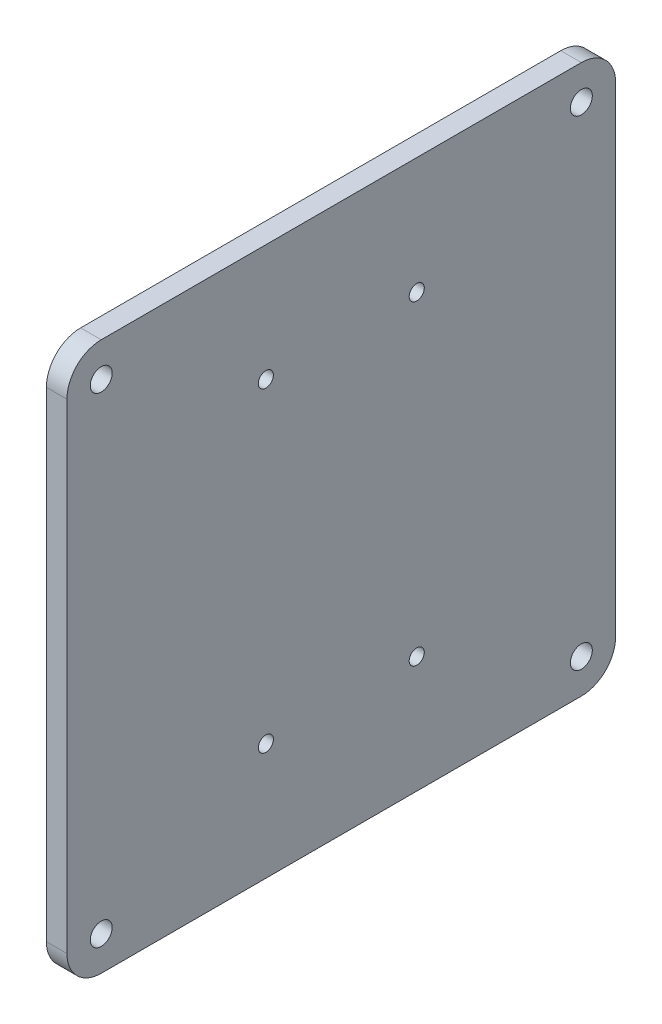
ISO-10303-21;
HEADER;
FILE_DESCRIPTION(('STEP AP214'),'2;1');
FILE_NAME('part.step','',(''),(''),'','','');
FILE_SCHEMA(('AUTOMOTIVE_DESIGN { 1 0 10303 214 1 1 1 1 }'));
ENDSEC;
DATA;
#1=APPLICATION_CONTEXT('core data for automotive mechanical design processes');
#2=APPLICATION_PROTOCOL_DEFINITION('international standard','automotive_design',2000,#1);
#3=PRODUCT_CONTEXT('',#1,'mechanical');
#4=PRODUCT('Part','Part','',(#3));
#5=PRODUCT_RELATED_PRODUCT_CATEGORY('part','',(#4));
#6=PRODUCT_DEFINITION_FORMATION('','',#4);
#7=PRODUCT_DEFINITION_CONTEXT('part definition',#1,'design');
#8=PRODUCT_DEFINITION('design','',#6,#7);
#9=PRODUCT_DEFINITION_SHAPE('','',#8);
#10=(LENGTH_UNIT() NAMED_UNIT(*) SI_UNIT(.MILLI.,.METRE.));
#11=(NAMED_UNIT(*) PLANE_ANGLE_UNIT() SI_UNIT($,.RADIAN.));
#12=(NAMED_UNIT(*) SI_UNIT($,.STERADIAN.) SOLID_ANGLE_UNIT());
#13=UNCERTAINTY_MEASURE_WITH_UNIT(LENGTH_MEASURE(1.E-05),#10,'distance_accuracy_value','');
#14=(GEOMETRIC_REPRESENTATION_CONTEXT(3) GLOBAL_UNCERTAINTY_ASSIGNED_CONTEXT((#13)) GLOBAL_UNIT_ASSIGNED_CONTEXT((#10,
#11,#12)) REPRESENTATION_CONTEXT('',''));
#15=CARTESIAN_POINT('',(0.,0.,0.));
#16=DIRECTION('',(0.,0.,1.));
#17=DIRECTION('',(1.,0.,0.));
#18=AXIS2_PLACEMENT_3D('',#15,#16,#17);
#19=CARTESIAN_POINT('',(3.,-35.,35.));
#20=DIRECTION('',(-1.,0.,0.));
#21=DIRECTION('',(0.,0.,1.));
#22=AXIS2_PLACEMENT_3D('',#19,#20,#21);
#23=PLANE('',#22);
#24=CARTESIAN_POINT('',(3.,-23.,11.));
#25=DIRECTION('',(1.,0.,0.));
#26=DIRECTION('',(0.,0.,1.));
#27=AXIS2_PLACEMENT_3D('',#24,#25,#26);
#28=CIRCLE('',#27,1.1);
#29=CARTESIAN_POINT('',(3.,-23.,12.1));
#30=VERTEX_POINT('',#29);
#31=EDGE_CURVE('E212',#30,#30,#28,.T.);
#32=ORIENTED_EDGE('',*,*,#31,.F.);
#33=EDGE_LOOP('',(#32));
#34=FACE_BOUND('',#33,.T.);
#35=CARTESIAN_POINT('',(3.,-35.,-35.));
#36=DIRECTION('',(1.,0.,0.));
#37=DIRECTION('',(0.,0.,-1.));
#38=AXIS2_PLACEMENT_3D('',#35,#36,#37);
#39=CIRCLE('',#38,1.6);
#40=CARTESIAN_POINT('',(3.,-35.,-36.6));
#41=VERTEX_POINT('',#40);
#42=EDGE_CURVE('E200',#41,#41,#39,.T.);
#43=ORIENTED_EDGE('',*,*,#42,.F.);
#44=EDGE_LOOP('',(#43));
#45=FACE_BOUND('',#44,.T.);
#46=CARTESIAN_POINT('',(3.,35.,-35.));
#47=DIRECTION('',(1.,0.,0.));
#48=DIRECTION('',(0.,0.,1.));
#49=AXIS2_PLACEMENT_3D('',#46,#47,#48);
#50=CIRCLE('',#49,1.6);
#51=CARTESIAN_POINT('',(3.,35.,-33.4));
#52=VERTEX_POINT('',#51);
#53=EDGE_CURVE('E188',#52,#52,#50,.T.);
#54=ORIENTED_EDGE('',*,*,#53,.F.);
#55=EDGE_LOOP('',(#54));
#56=FACE_BOUND('',#55,.T.);
#57=CARTESIAN_POINT('',(3.,35.,35.));
#58=DIRECTION('',(1.,0.,0.));
#59=DIRECTION('',(0.,0.,-1.));
#60=AXIS2_PLACEMENT_3D('',#57,#58,#59);
#61=CIRCLE('',#60,1.6);
#62=CARTESIAN_POINT('',(3.,35.,33.4));
#63=VERTEX_POINT('',#62);
#64=EDGE_CURVE('E134',#63,#63,#61,.T.);
#65=ORIENTED_EDGE('',*,*,#64,.F.);
#66=EDGE_LOOP('',(#65));
#67=FACE_BOUND('',#66,.T.);
#68=CARTESIAN_POINT('',(3.,-35.,35.));
#69=DIRECTION('',(1.,0.,0.));
#70=DIRECTION('',(0.,0.,1.));
#71=AXIS2_PLACEMENT_3D('',#68,#69,#70);
#72=CIRCLE('',#71,5.);
#73=CARTESIAN_POINT('',(3.,-35.,40.));
#74=VERTEX_POINT('',#73);
#75=CARTESIAN_POINT('',(3.,-40.,35.));
#76=VERTEX_POINT('',#75);
#77=EDGE_CURVE('E145',#74,#76,#72,.T.);
#78=ORIENTED_EDGE('',*,*,#77,.T.);
#79=DIRECTION('',(0.,0.,-1.));
#80=VECTOR('',#79,1.);
#81=CARTESIAN_POINT('',(3.,-40.,-35.));
#82=LINE('',#81,#80);
#83=CARTESIAN_POINT('',(3.,-40.,-35.));
#84=VERTEX_POINT('',#83);
#85=EDGE_CURVE('E93',#76,#84,#82,.T.);
#86=ORIENTED_EDGE('',*,*,#85,.T.);
#87=CARTESIAN_POINT('',(3.,-35.,-35.));
#88=DIRECTION('',(1.,0.,0.));
#89=DIRECTION('',(0.,0.,1.));
#90=AXIS2_PLACEMENT_3D('',#87,#88,#89);
#91=CIRCLE('',#90,5.);
#92=CARTESIAN_POINT('',(3.,-35.,-40.));
#93=VERTEX_POINT('',#92);
#94=EDGE_CURVE('E160',#84,#93,#91,.T.);
#95=ORIENTED_EDGE('',*,*,#94,.T.);
#96=DIRECTION('',(0.,1.,0.));
#97=VECTOR('',#96,1.);
#98=CARTESIAN_POINT('',(3.,35.,-40.));
#99=LINE('',#98,#97);
#100=CARTESIAN_POINT('',(3.,35.,-40.));
#101=VERTEX_POINT('',#100);
#102=EDGE_CURVE('E173',#93,#101,#99,.T.);
#103=ORIENTED_EDGE('',*,*,#102,.T.);
#104=CARTESIAN_POINT('',(3.,35.,-35.));
#105=DIRECTION('',(1.,0.,0.));
#106=DIRECTION('',(0.,0.,1.));
#107=AXIS2_PLACEMENT_3D('',#104,#105,#106);
#108=CIRCLE('',#107,5.);
#109=CARTESIAN_POINT('',(3.,40.,-35.));
#110=VERTEX_POINT('',#109);
#111=EDGE_CURVE('E112',#101,#110,#108,.T.);
#112=ORIENTED_EDGE('',*,*,#111,.T.);
#113=DIRECTION('',(0.,0.,1.));
#114=VECTOR('',#113,1.);
#115=CARTESIAN_POINT('',(3.,40.,-35.));
#116=LINE('',#115,#114);
#117=CARTESIAN_POINT('',(3.,40.,35.));
#118=VERTEX_POINT('',#117);
#119=EDGE_CURVE('E106',#110,#118,#116,.T.);
#120=ORIENTED_EDGE('',*,*,#119,.T.);
#121=CARTESIAN_POINT('',(3.,35.,35.));
#122=DIRECTION('',(1.,0.,0.));
#123=DIRECTION('',(0.,0.,-1.));
#124=AXIS2_PLACEMENT_3D('',#121,#122,#123);
#125=CIRCLE('',#124,5.);
#126=CARTESIAN_POINT('',(3.,35.,40.));
#127=VERTEX_POINT('',#126);
#128=EDGE_CURVE('E110',#118,#127,#125,.T.);
#129=ORIENTED_EDGE('',*,*,#128,.T.);
#130=DIRECTION('',(0.,-1.,0.));
#131=VECTOR('',#130,1.);
#132=CARTESIAN_POINT('',(3.,35.,40.));
#133=LINE('',#132,#131);
#134=EDGE_CURVE('E50',#127,#74,#133,.T.);
#135=ORIENTED_EDGE('',*,*,#134,.T.);
#136=EDGE_LOOP('',(#78,#86,#95,#103,#112,#120,#129,#135));
#137=FACE_BOUND('',#136,.T.);
#138=CARTESIAN_POINT('',(3.,23.,11.));
#139=DIRECTION('',(1.,0.,0.));
#140=DIRECTION('',(0.,0.,-1.));
#141=AXIS2_PLACEMENT_3D('',#138,#139,#140);
#142=CIRCLE('',#141,1.1);
#143=CARTESIAN_POINT('',(3.,23.,9.9));
#144=VERTEX_POINT('',#143);
#145=EDGE_CURVE('E182',#144,#144,#142,.T.);
#146=ORIENTED_EDGE('',*,*,#145,.F.);
#147=EDGE_LOOP('',(#146));
#148=FACE_BOUND('',#147,.T.);
#149=CARTESIAN_POINT('',(3.,23.,-11.));
#150=DIRECTION('',(1.,0.,0.));
#151=DIRECTION('',(0.,0.,1.));
#152=AXIS2_PLACEMENT_3D('',#149,#150,#151);
#153=CIRCLE('',#152,1.1);
#154=CARTESIAN_POINT('',(3.,23.,-9.9));
#155=VERTEX_POINT('',#154);
#156=EDGE_CURVE('E194',#155,#155,#153,.T.);
#157=ORIENTED_EDGE('',*,*,#156,.F.);
#158=EDGE_LOOP('',(#157));
#159=FACE_BOUND('',#158,.T.);
#160=CARTESIAN_POINT('',(3.,-23.,-11.));
#161=DIRECTION('',(1.,0.,0.));
#162=DIRECTION('',(0.,0.,-1.));
#163=AXIS2_PLACEMENT_3D('',#160,#161,#162);
#164=CIRCLE('',#163,1.1);
#165=CARTESIAN_POINT('',(3.,-23.,-12.1));
#166=VERTEX_POINT('',#165);
#167=EDGE_CURVE('E206',#166,#166,#164,.T.);
#168=ORIENTED_EDGE('',*,*,#167,.F.);
#169=EDGE_LOOP('',(#168));
#170=FACE_BOUND('',#169,.T.);
#171=CARTESIAN_POINT('',(3.,-35.,35.));
#172=DIRECTION('',(1.,0.,0.));
#173=DIRECTION('',(0.,0.,1.));
#174=AXIS2_PLACEMENT_3D('',#171,#172,#173);
#175=CIRCLE('',#174,1.6);
#176=CARTESIAN_POINT('',(3.,-35.,36.6));
#177=VERTEX_POINT('',#176);
#178=EDGE_CURVE('E218',#177,#177,#175,.T.);
#179=ORIENTED_EDGE('',*,*,#178,.F.);
#180=EDGE_LOOP('',(#179));
#181=FACE_BOUND('',#180,.T.);
#182=ADVANCED_FACE('F33',(#34,#45,#56,#67,#137,#148,#159,#170,#181),#23,.F.);
#183=CARTESIAN_POINT('',(0.,-35.,35.));
#184=DIRECTION('',(-1.,0.,0.));
#185=DIRECTION('',(0.,0.,1.));
#186=AXIS2_PLACEMENT_3D('',#183,#184,#185);
#187=PLANE('',#186);
#188=CARTESIAN_POINT('',(0.,-23.,11.));
#189=DIRECTION('',(1.,0.,0.));
#190=DIRECTION('',(0.,0.,1.));
#191=AXIS2_PLACEMENT_3D('',#188,#189,#190);
#192=CIRCLE('',#191,1.1);
#193=CARTESIAN_POINT('',(0.,-23.,12.1));
#194=VERTEX_POINT('',#193);
#195=EDGE_CURVE('E215',#194,#194,#192,.T.);
#196=ORIENTED_EDGE('',*,*,#195,.T.);
#197=EDGE_LOOP('',(#196));
#198=FACE_BOUND('',#197,.T.);
#199=CARTESIAN_POINT('',(0.,-35.,-35.));
#200=DIRECTION('',(1.,0.,0.));
#201=DIRECTION('',(0.,0.,-1.));
#202=AXIS2_PLACEMENT_3D('',#199,#200,#201);
#203=CIRCLE('',#202,1.6);
#204=CARTESIAN_POINT('',(0.,-35.,-36.6));
#205=VERTEX_POINT('',#204);
#206=EDGE_CURVE('E203',#205,#205,#203,.T.);
#207=ORIENTED_EDGE('',*,*,#206,.T.);
#208=EDGE_LOOP('',(#207));
#209=FACE_BOUND('',#208,.T.);
#210=CARTESIAN_POINT('',(0.,35.,-35.));
#211=DIRECTION('',(1.,0.,0.));
#212=DIRECTION('',(0.,0.,1.));
#213=AXIS2_PLACEMENT_3D('',#210,#211,#212);
#214=CIRCLE('',#213,1.6);
#215=CARTESIAN_POINT('',(0.,35.,-33.4));
#216=VERTEX_POINT('',#215);
#217=EDGE_CURVE('E191',#216,#216,#214,.T.);
#218=ORIENTED_EDGE('',*,*,#217,.T.);
#219=EDGE_LOOP('',(#218));
#220=FACE_BOUND('',#219,.T.);
#221=CARTESIAN_POINT('',(0.,35.,35.));
#222=DIRECTION('',(1.,0.,0.));
#223=DIRECTION('',(0.,0.,-1.));
#224=AXIS2_PLACEMENT_3D('',#221,#222,#223);
#225=CIRCLE('',#224,1.6);
#226=CARTESIAN_POINT('',(0.,35.,33.4));
#227=VERTEX_POINT('',#226);
#228=EDGE_CURVE('E179',#227,#227,#225,.T.);
#229=ORIENTED_EDGE('',*,*,#228,.T.);
#230=EDGE_LOOP('',(#229));
#231=FACE_BOUND('',#230,.T.);
#232=CARTESIAN_POINT('',(0.,-35.,35.));
#233=DIRECTION('',(1.,0.,0.));
#234=DIRECTION('',(0.,0.,1.));
#235=AXIS2_PLACEMENT_3D('',#232,#233,#234);
#236=CIRCLE('',#235,5.);
#237=CARTESIAN_POINT('',(0.,-35.,40.));
#238=VERTEX_POINT('',#237);
#239=CARTESIAN_POINT('',(0.,-40.,35.));
#240=VERTEX_POINT('',#239);
#241=EDGE_CURVE('E130',#238,#240,#236,.T.);
#242=ORIENTED_EDGE('',*,*,#241,.F.);
#243=DIRECTION('',(0.,-1.,0.));
#244=VECTOR('',#243,1.);
#245=CARTESIAN_POINT('',(0.,35.,40.));
#246=LINE('',#245,#244);
#247=CARTESIAN_POINT('',(0.,35.,40.));
#248=VERTEX_POINT('',#247);
#249=EDGE_CURVE('E85',#248,#238,#246,.T.);
#250=ORIENTED_EDGE('',*,*,#249,.F.);
#251=CARTESIAN_POINT('',(0.,35.,35.));
#252=DIRECTION('',(1.,0.,0.));
#253=DIRECTION('',(0.,0.,-1.));
#254=AXIS2_PLACEMENT_3D('',#251,#252,#253);
#255=CIRCLE('',#254,5.);
#256=CARTESIAN_POINT('',(0.,40.,35.));
#257=VERTEX_POINT('',#256);
#258=EDGE_CURVE('E79',#257,#248,#255,.T.);
#259=ORIENTED_EDGE('',*,*,#258,.F.);
#260=DIRECTION('',(0.,0.,1.));
#261=VECTOR('',#260,1.);
#262=CARTESIAN_POINT('',(0.,40.,-35.));
#263=LINE('',#262,#261);
#264=CARTESIAN_POINT('',(0.,40.,-35.));
#265=VERTEX_POINT('',#264);
#266=EDGE_CURVE('E120',#265,#257,#263,.T.);
#267=ORIENTED_EDGE('',*,*,#266,.F.);
#268=CARTESIAN_POINT('',(0.,35.,-35.));
#269=DIRECTION('',(1.,0.,0.));
#270=DIRECTION('',(0.,0.,1.));
#271=AXIS2_PLACEMENT_3D('',#268,#269,#270);
#272=CIRCLE('',#271,5.);
#273=CARTESIAN_POINT('',(0.,35.,-40.));
#274=VERTEX_POINT('',#273);
#275=EDGE_CURVE('E140',#274,#265,#272,.T.);
#276=ORIENTED_EDGE('',*,*,#275,.F.);
#277=DIRECTION('',(0.,1.,0.));
#278=VECTOR('',#277,1.);
#279=CARTESIAN_POINT('',(0.,35.,-40.));
#280=LINE('',#279,#278);
#281=CARTESIAN_POINT('',(0.,-35.,-40.));
#282=VERTEX_POINT('',#281);
#283=EDGE_CURVE('E138',#282,#274,#280,.T.);
#284=ORIENTED_EDGE('',*,*,#283,.F.);
#285=CARTESIAN_POINT('',(0.,-35.,-35.));
#286=DIRECTION('',(1.,0.,0.));
#287=DIRECTION('',(0.,0.,1.));
#288=AXIS2_PLACEMENT_3D('',#285,#286,#287);
#289=CIRCLE('',#288,5.);
#290=CARTESIAN_POINT('',(0.,-40.,-35.));
#291=VERTEX_POINT('',#290);
#292=EDGE_CURVE('E136',#291,#282,#289,.T.);
#293=ORIENTED_EDGE('',*,*,#292,.F.);
#294=DIRECTION('',(0.,0.,-1.));
#295=VECTOR('',#294,1.);
#296=CARTESIAN_POINT('',(0.,-40.,-35.));
#297=LINE('',#296,#295);
#298=EDGE_CURVE('E133',#240,#291,#297,.T.);
#299=ORIENTED_EDGE('',*,*,#298,.F.);
#300=EDGE_LOOP('',(#242,#250,#259,#267,#276,#284,#293,#299));
#301=FACE_BOUND('',#300,.T.);
#302=CARTESIAN_POINT('',(0.,23.,11.));
#303=DIRECTION('',(1.,0.,0.));
#304=DIRECTION('',(0.,0.,-1.));
#305=AXIS2_PLACEMENT_3D('',#302,#303,#304);
#306=CIRCLE('',#305,1.1);
#307=CARTESIAN_POINT('',(0.,23.,9.9));
#308=VERTEX_POINT('',#307);
#309=EDGE_CURVE('E185',#308,#308,#306,.T.);
#310=ORIENTED_EDGE('',*,*,#309,.T.);
#311=EDGE_LOOP('',(#310));
#312=FACE_BOUND('',#311,.T.);
#313=CARTESIAN_POINT('',(0.,23.,-11.));
#314=DIRECTION('',(1.,0.,0.));
#315=DIRECTION('',(0.,0.,1.));
#316=AXIS2_PLACEMENT_3D('',#313,#314,#315);
#317=CIRCLE('',#316,1.1);
#318=CARTESIAN_POINT('',(0.,23.,-9.9));
#319=VERTEX_POINT('',#318);
#320=EDGE_CURVE('E197',#319,#319,#317,.T.);
#321=ORIENTED_EDGE('',*,*,#320,.T.);
#322=EDGE_LOOP('',(#321));
#323=FACE_BOUND('',#322,.T.);
#324=CARTESIAN_POINT('',(0.,-23.,-11.));
#325=DIRECTION('',(1.,0.,0.));
#326=DIRECTION('',(0.,0.,-1.));
#327=AXIS2_PLACEMENT_3D('',#324,#325,#326);
#328=CIRCLE('',#327,1.1);
#329=CARTESIAN_POINT('',(0.,-23.,-12.1));
#330=VERTEX_POINT('',#329);
#331=EDGE_CURVE('E209',#330,#330,#328,.T.);
#332=ORIENTED_EDGE('',*,*,#331,.T.);
#333=EDGE_LOOP('',(#332));
#334=FACE_BOUND('',#333,.T.);
#335=CARTESIAN_POINT('',(0.,-35.,35.));
#336=DIRECTION('',(1.,0.,0.));
#337=DIRECTION('',(0.,0.,1.));
#338=AXIS2_PLACEMENT_3D('',#335,#336,#337);
#339=CIRCLE('',#338,1.6);
#340=CARTESIAN_POINT('',(0.,-35.,36.6));
#341=VERTEX_POINT('',#340);
#342=EDGE_CURVE('E221',#341,#341,#339,.T.);
#343=ORIENTED_EDGE('',*,*,#342,.T.);
#344=EDGE_LOOP('',(#343));
#345=FACE_BOUND('',#344,.T.);
#346=ADVANCED_FACE('F164',(#198,#209,#220,#231,#301,#312,#323,#334,#345),#187,.T.);
#347=CARTESIAN_POINT('',(3.,-35.,35.));
#348=DIRECTION('',(-1.,0.,0.));
#349=DIRECTION('',(0.,0.,1.));
#350=AXIS2_PLACEMENT_3D('',#347,#348,#349);
#351=CYLINDRICAL_SURFACE('',#350,5.);
#352=ORIENTED_EDGE('',*,*,#241,.T.);
#353=DIRECTION('',(-1.,0.,0.));
#354=VECTOR('',#353,1.);
#355=CARTESIAN_POINT('',(3.,-40.,35.));
#356=LINE('',#355,#354);
#357=EDGE_CURVE('E11',#76,#240,#356,.T.);
#358=ORIENTED_EDGE('',*,*,#357,.F.);
#359=ORIENTED_EDGE('',*,*,#77,.F.);
#360=DIRECTION('',(-1.,0.,0.));
#361=VECTOR('',#360,1.);
#362=CARTESIAN_POINT('',(3.,-35.,40.));
#363=LINE('',#362,#361);
#364=EDGE_CURVE('E126',#74,#238,#363,.T.);
#365=ORIENTED_EDGE('',*,*,#364,.T.);
#366=EDGE_LOOP('',(#352,#358,#359,#365));
#367=FACE_BOUND('',#366,.T.);
#368=ADVANCED_FACE('F35',(#367),#351,.T.);
#369=CARTESIAN_POINT('',(3.,-40.,-35.));
#370=DIRECTION('',(0.,1.,0.));
#371=DIRECTION('',(0.,0.,1.));
#372=AXIS2_PLACEMENT_3D('',#369,#370,#371);
#373=PLANE('',#372);
#374=ORIENTED_EDGE('',*,*,#298,.T.);
#375=DIRECTION('',(-1.,0.,0.));
#376=VECTOR('',#375,1.);
#377=CARTESIAN_POINT('',(3.,-40.,-35.));
#378=LINE('',#377,#376);
#379=EDGE_CURVE('E42',#84,#291,#378,.T.);
#380=ORIENTED_EDGE('',*,*,#379,.F.);
#381=ORIENTED_EDGE('',*,*,#85,.F.);
#382=ORIENTED_EDGE('',*,*,#357,.T.);
#383=EDGE_LOOP('',(#374,#380,#381,#382));
#384=FACE_BOUND('',#383,.T.);
#385=ADVANCED_FACE('F256',(#384),#373,.F.);
#386=CARTESIAN_POINT('',(3.,-35.,-35.));
#387=DIRECTION('',(-1.,0.,0.));
#388=DIRECTION('',(0.,0.,1.));
#389=AXIS2_PLACEMENT_3D('',#386,#387,#388);
#390=CYLINDRICAL_SURFACE('',#389,5.);
#391=ORIENTED_EDGE('',*,*,#292,.T.);
#392=DIRECTION('',(-1.,0.,0.));
#393=VECTOR('',#392,1.);
#394=CARTESIAN_POINT('',(3.,-35.,-40.));
#395=LINE('',#394,#393);
#396=EDGE_CURVE('E152',#93,#282,#395,.T.);
#397=ORIENTED_EDGE('',*,*,#396,.F.);
#398=ORIENTED_EDGE('',*,*,#94,.F.);
#399=ORIENTED_EDGE('',*,*,#379,.T.);
#400=EDGE_LOOP('',(#391,#397,#398,#399));
#401=FACE_BOUND('',#400,.T.);
#402=ADVANCED_FACE('F158',(#401),#390,.T.);
#403=CARTESIAN_POINT('',(3.,35.,-40.));
#404=DIRECTION('',(0.,0.,1.));
#405=DIRECTION('',(0.,-1.,0.));
#406=AXIS2_PLACEMENT_3D('',#403,#404,#405);
#407=PLANE('',#406);
#408=ORIENTED_EDGE('',*,*,#283,.T.);
#409=DIRECTION('',(-1.,0.,0.));
#410=VECTOR('',#409,1.);
#411=CARTESIAN_POINT('',(3.,35.,-40.));
#412=LINE('',#411,#410);
#413=EDGE_CURVE('E149',#101,#274,#412,.T.);
#414=ORIENTED_EDGE('',*,*,#413,.F.);
#415=ORIENTED_EDGE('',*,*,#102,.F.);
#416=ORIENTED_EDGE('',*,*,#396,.T.);
#417=EDGE_LOOP('',(#408,#414,#415,#416));
#418=FACE_BOUND('',#417,.T.);
#419=ADVANCED_FACE('F169',(#418),#407,.F.);
#420=CARTESIAN_POINT('',(3.,35.,-35.));
#421=DIRECTION('',(-1.,0.,0.));
#422=DIRECTION('',(0.,0.,1.));
#423=AXIS2_PLACEMENT_3D('',#420,#421,#422);
#424=CYLINDRICAL_SURFACE('',#423,5.);
#425=ORIENTED_EDGE('',*,*,#275,.T.);
#426=DIRECTION('',(-1.,0.,0.));
#427=VECTOR('',#426,1.);
#428=CARTESIAN_POINT('',(3.,40.,-35.));
#429=LINE('',#428,#427);
#430=EDGE_CURVE('E121',#110,#265,#429,.T.);
#431=ORIENTED_EDGE('',*,*,#430,.F.);
#432=ORIENTED_EDGE('',*,*,#111,.F.);
#433=ORIENTED_EDGE('',*,*,#413,.T.);
#434=EDGE_LOOP('',(#425,#431,#432,#433));
#435=FACE_BOUND('',#434,.T.);
#436=ADVANCED_FACE('F172',(#435),#424,.T.);
#437=CARTESIAN_POINT('',(3.,40.,-35.));
#438=DIRECTION('',(0.,-1.,0.));
#439=DIRECTION('',(0.,0.,-1.));
#440=AXIS2_PLACEMENT_3D('',#437,#438,#439);
#441=PLANE('',#440);
#442=ORIENTED_EDGE('',*,*,#266,.T.);
#443=DIRECTION('',(-1.,0.,0.));
#444=VECTOR('',#443,1.);
#445=CARTESIAN_POINT('',(3.,40.,35.));
#446=LINE('',#445,#444);
#447=EDGE_CURVE('E117',#118,#257,#446,.T.);
#448=ORIENTED_EDGE('',*,*,#447,.F.);
#449=ORIENTED_EDGE('',*,*,#119,.F.);
#450=ORIENTED_EDGE('',*,*,#430,.T.);
#451=EDGE_LOOP('',(#442,#448,#449,#450));
#452=FACE_BOUND('',#451,.T.);
#453=ADVANCED_FACE('F118',(#452),#441,.F.);
#454=CARTESIAN_POINT('',(3.,35.,35.));
#455=DIRECTION('',(-1.,0.,0.));
#456=DIRECTION('',(0.,0.,1.));
#457=AXIS2_PLACEMENT_3D('',#454,#455,#456);
#458=CYLINDRICAL_SURFACE('',#457,5.);
#459=ORIENTED_EDGE('',*,*,#258,.T.);
#460=DIRECTION('',(-1.,0.,0.));
#461=VECTOR('',#460,1.);
#462=CARTESIAN_POINT('',(3.,35.,40.));
#463=LINE('',#462,#461);
#464=EDGE_CURVE('E122',#127,#248,#463,.T.);
#465=ORIENTED_EDGE('',*,*,#464,.F.);
#466=ORIENTED_EDGE('',*,*,#128,.F.);
#467=ORIENTED_EDGE('',*,*,#447,.T.);
#468=EDGE_LOOP('',(#459,#465,#466,#467));
#469=FACE_BOUND('',#468,.T.);
#470=ADVANCED_FACE('F124',(#469),#458,.T.);
#471=CARTESIAN_POINT('',(3.,35.,40.));
#472=DIRECTION('',(0.,0.,-1.));
#473=DIRECTION('',(0.,1.,0.));
#474=AXIS2_PLACEMENT_3D('',#471,#472,#473);
#475=PLANE('',#474);
#476=ORIENTED_EDGE('',*,*,#249,.T.);
#477=ORIENTED_EDGE('',*,*,#364,.F.);
#478=ORIENTED_EDGE('',*,*,#134,.F.);
#479=ORIENTED_EDGE('',*,*,#464,.T.);
#480=EDGE_LOOP('',(#476,#477,#478,#479));
#481=FACE_BOUND('',#480,.T.);
#482=ADVANCED_FACE('F244',(#481),#475,.F.);
#483=CARTESIAN_POINT('',(3.,35.,35.));
#484=DIRECTION('',(-1.,0.,0.));
#485=DIRECTION('',(0.,0.,1.));
#486=AXIS2_PLACEMENT_3D('',#483,#484,#485);
#487=CYLINDRICAL_SURFACE('',#486,1.6);
#488=ORIENTED_EDGE('',*,*,#64,.T.);
#489=EDGE_LOOP('',(#488));
#490=FACE_BOUND('',#489,.T.);
#491=ORIENTED_EDGE('',*,*,#228,.F.);
#492=EDGE_LOOP('',(#491));
#493=FACE_BOUND('',#492,.T.);
#494=ADVANCED_FACE('F241',(#490,#493),#487,.F.);
#495=CARTESIAN_POINT('',(3.,23.,11.));
#496=DIRECTION('',(-1.,0.,0.));
#497=DIRECTION('',(0.,0.,1.));
#498=AXIS2_PLACEMENT_3D('',#495,#496,#497);
#499=CYLINDRICAL_SURFACE('',#498,1.1);
#500=ORIENTED_EDGE('',*,*,#145,.T.);
#501=EDGE_LOOP('',(#500));
#502=FACE_BOUND('',#501,.T.);
#503=ORIENTED_EDGE('',*,*,#309,.F.);
#504=EDGE_LOOP('',(#503));
#505=FACE_BOUND('',#504,.T.);
#506=ADVANCED_FACE('F320',(#502,#505),#499,.F.);
#507=CARTESIAN_POINT('',(3.,35.,-35.));
#508=DIRECTION('',(-1.,0.,0.));
#509=DIRECTION('',(0.,0.,1.));
#510=AXIS2_PLACEMENT_3D('',#507,#508,#509);
#511=CYLINDRICAL_SURFACE('',#510,1.6);
#512=ORIENTED_EDGE('',*,*,#53,.T.);
#513=EDGE_LOOP('',(#512));
#514=FACE_BOUND('',#513,.T.);
#515=ORIENTED_EDGE('',*,*,#217,.F.);
#516=EDGE_LOOP('',(#515));
#517=FACE_BOUND('',#516,.T.);
#518=ADVANCED_FACE('F328',(#514,#517),#511,.F.);
#519=CARTESIAN_POINT('',(3.,23.,-11.));
#520=DIRECTION('',(-1.,0.,0.));
#521=DIRECTION('',(0.,0.,1.));
#522=AXIS2_PLACEMENT_3D('',#519,#520,#521);
#523=CYLINDRICAL_SURFACE('',#522,1.1);
#524=ORIENTED_EDGE('',*,*,#156,.T.);
#525=EDGE_LOOP('',(#524));
#526=FACE_BOUND('',#525,.T.);
#527=ORIENTED_EDGE('',*,*,#320,.F.);
#528=EDGE_LOOP('',(#527));
#529=FACE_BOUND('',#528,.T.);
#530=ADVANCED_FACE('F336',(#526,#529),#523,.F.);
#531=CARTESIAN_POINT('',(3.,-35.,-35.));
#532=DIRECTION('',(-1.,0.,0.));
#533=DIRECTION('',(0.,0.,1.));
#534=AXIS2_PLACEMENT_3D('',#531,#532,#533);
#535=CYLINDRICAL_SURFACE('',#534,1.6);
#536=ORIENTED_EDGE('',*,*,#42,.T.);
#537=EDGE_LOOP('',(#536));
#538=FACE_BOUND('',#537,.T.);
#539=ORIENTED_EDGE('',*,*,#206,.F.);
#540=EDGE_LOOP('',(#539));
#541=FACE_BOUND('',#540,.T.);
#542=ADVANCED_FACE('F345',(#538,#541),#535,.F.);
#543=CARTESIAN_POINT('',(3.,-23.,-11.));
#544=DIRECTION('',(-1.,0.,0.));
#545=DIRECTION('',(0.,0.,1.));
#546=AXIS2_PLACEMENT_3D('',#543,#544,#545);
#547=CYLINDRICAL_SURFACE('',#546,1.1);
#548=ORIENTED_EDGE('',*,*,#167,.T.);
#549=EDGE_LOOP('',(#548));
#550=FACE_BOUND('',#549,.T.);
#551=ORIENTED_EDGE('',*,*,#331,.F.);
#552=EDGE_LOOP('',(#551));
#553=FACE_BOUND('',#552,.T.);
#554=ADVANCED_FACE('F354',(#550,#553),#547,.F.);
#555=CARTESIAN_POINT('',(3.,-23.,11.));
#556=DIRECTION('',(-1.,0.,0.));
#557=DIRECTION('',(0.,0.,1.));
#558=AXIS2_PLACEMENT_3D('',#555,#556,#557);
#559=CYLINDRICAL_SURFACE('',#558,1.1);
#560=ORIENTED_EDGE('',*,*,#31,.T.);
#561=EDGE_LOOP('',(#560));
#562=FACE_BOUND('',#561,.T.);
#563=ORIENTED_EDGE('',*,*,#195,.F.);
#564=EDGE_LOOP('',(#563));
#565=FACE_BOUND('',#564,.T.);
#566=ADVANCED_FACE('F363',(#562,#565),#559,.F.);
#567=CARTESIAN_POINT('',(3.,-35.,35.));
#568=DIRECTION('',(-1.,0.,0.));
#569=DIRECTION('',(0.,0.,1.));
#570=AXIS2_PLACEMENT_3D('',#567,#568,#569);
#571=CYLINDRICAL_SURFACE('',#570,1.6);
#572=ORIENTED_EDGE('',*,*,#178,.T.);
#573=EDGE_LOOP('',(#572));
#574=FACE_BOUND('',#573,.T.);
#575=ORIENTED_EDGE('',*,*,#342,.F.);
#576=EDGE_LOOP('',(#575));
#577=FACE_BOUND('',#576,.T.);
#578=ADVANCED_FACE('F227',(#574,#577),#571,.F.);
#579=CLOSED_SHELL('',(#182,#346,#368,#385,#402,#419,#436,#453,#470,#482,#494,#506,#518,#530,
#542,#554,#566,#578));
#580=MANIFOLD_SOLID_BREP('B2',#579);
#581=ADVANCED_BREP_SHAPE_REPRESENTATION('',(#18,#580),#14);
#582=SHAPE_DEFINITION_REPRESENTATION(#9,#581);
ENDSEC;
END-ISO-10303-21;
